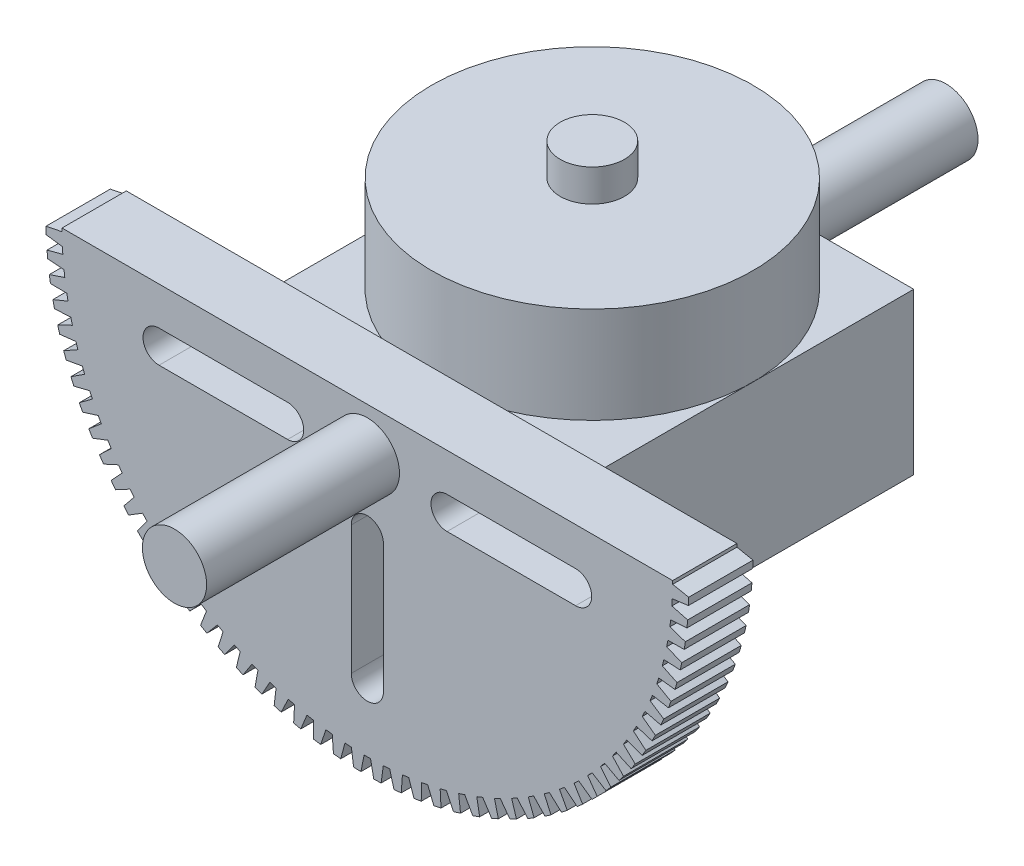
from build123d import *

# Parameters (mm, degrees)
BOSS_EXTRUDE1_DEPTH      = 5
SKETCH3_W                = 50
SKETCH3_H                = 25
BOSS_EXTRUDE2_DEPTH      = 50
SKETCH4_R                = 25
BOSS_EXTRUDE5_DEPTH      = 20
SKETCH5_R                = 25
SKETCH5_R_2              = 5
CUT_EXTRUDE1_DEPTH       = 5
BOSS_EXTRUDE7_DEPTH      = 35
BOSS_EXTRUDE7_DEPTH_BACK = 85
SKETCH6_R                = 5


with BuildPart() as part:
    # Sketch1 → Boss-Extrude1 (new, symmetric)
    with BuildSketch(Plane.XY):
        with BuildLine():
            Line((-47.5, 0), (-15, 0))
            Line((-15, 0), (15, 0))
            Line((15, 0), (47.5, 0))
            Line((47.5, 0), (47.5, -0.5))
            Line((47.5, -0.5), (49.989999, -1))
            ThreePointArc((49.989999, -1), (49.975328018, -1.570537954), (49.954145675, -2.14087128))
            Line((49.954145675, -2.14087128), (47.43766486, -2.483536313))
            Line((47.43766486, -2.483536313), (47.374874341, -3.481563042))
            Line((47.374874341, -3.481563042), (49.828564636, -4.136924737))
            ThreePointArc((49.828564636, -4.136924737), (49.77809823, -4.705415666), (49.72114616, -5.273293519))
            Line((49.72114616, -5.273293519), (47.188114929, -5.457271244))
            Line((47.188114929, -5.457271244), (47.062781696, -6.449385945))
            Line((47.062781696, -6.449385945), (49.470479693, -7.257522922))
            ThreePointArc((49.470479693, -7.257522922), (49.38441703, -7.821723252), (49.291919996, -8.384904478))
            Line((49.291919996, -8.384904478), (46.752335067, -8.409468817))
            Line((46.752335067, -8.409468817), (46.564953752, -9.391756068))
            Line((46.564953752, -9.391756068), (48.917157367, -10.349478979))
            ThreePointArc((48.917157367, -10.349478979), (48.795838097, -10.90716207), (48.668161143, -11.46342405))
            Line((48.668161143, -11.46342405), (46.132045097, -11.32847806))
            Line((46.132045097, -11.32847806), (45.88335521, -12.297061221))
            Line((45.88335521, -12.297061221), (48.170781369, -13.400590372))
            ThreePointArc((48.170781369, -13.400590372), (48.014684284, -13.949555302), (47.852331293, -14.496702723))
            Line((47.852331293, -14.496702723), (45.329693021, -14.202778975))
            Line((45.329693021, -14.202778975), (45.020676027, -15.153835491))
            Line((45.020676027, -15.153835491), (47.234297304, -16.398815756))
            ThreePointArc((47.234297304, -16.398815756), (47.044038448, -16.936896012), (46.847650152, -17.472769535))
            Line((46.847650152, -17.472769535), (44.348445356, -17.02102801))
            Line((44.348445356, -17.02102801), (43.980320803, -17.950804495))
            Line((43.980320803, -17.950804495), (46.111401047, -19.332322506))
            ThreePointArc((46.111401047, -19.332322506), (45.887731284, -19.857394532), (45.658082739, -20.379879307))
            Line((45.658082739, -20.379879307), (43.192174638, -19.772102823))
            Line((43.192174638, -19.772102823), (42.766395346, -20.676929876))
            Line((42.766395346, -20.676929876), (44.806524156, -22.189533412))
            ThreePointArc((44.806524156, -22.189533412), (44.550326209, -22.699524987), (44.288323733, -23.206559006))
            Line((44.288323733, -23.206559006), (41.865444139, -22.44514618))
            Line((41.865444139, -22.44514618), (41.383690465, -23.32145286))
            Line((41.383690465, -23.32145286), (43.324816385, -24.959172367))
            ThreePointArc((43.324816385, -24.959172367), (43.03710135, -25.452070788), (42.743778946, -25.94165302))
            Line((42.743778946, -25.94165302), (40.373489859, -25.029608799))
            Line((40.373489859, -25.029608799), (39.837663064, -25.873936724))
            Line((39.837663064, -25.873936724), (41.672125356, -27.630308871))
            ThreePointArc((41.672125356, -27.630308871), (41.354028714, -28.104168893), (41.030543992, -28.57436718))
            Line((41.030543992, -28.57436718), (38.722199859, -27.515290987))
            Line((38.722199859, -27.515290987), (38.134414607, -28.324307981))
            Line((38.134414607, -28.324307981), (39.854973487, -30.192401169))
            ThreePointArc((39.854973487, -30.192401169), (39.507750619, -30.645352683), (39.155380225, -31.094311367))
            Line((39.155380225, -31.094311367), (36.918091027, -29.892382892))
            Line((36.918091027, -29.892382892), (36.280667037, -30.662896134))
            Line((36.280667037, -30.662896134), (37.880532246, -32.635337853))
            ThreePointArc((37.880532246, -32.635337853), (37.505553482, -33.065593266), (37.125688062, -33.491540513))
            Line((37.125688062, -33.491540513), (34.968283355, -32.151503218))
            Line((34.968283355, -32.151503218), (34.28373625, -32.880471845))
            Line((34.28373625, -32.880471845), (35.75659385, -34.949477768))
            ThreePointArc((35.75659385, -34.949477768), (35.355339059, -35.355339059), (34.949477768, -35.75659385))
            Line((34.949477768, -35.75659385), (32.880471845, -34.28373625))
            Line((32.880471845, -34.28373625), (32.151503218, -34.968283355))
            Line((32.151503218, -34.968283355), (33.491540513, -37.125688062))
            ThreePointArc((33.491540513, -37.125688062), (33.065593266, -37.505553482), (32.635337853, -37.880532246))
            Line((32.635337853, -37.880532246), (30.662896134, -36.280667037))
            Line((30.662896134, -36.280667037), (29.892382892, -36.918091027))
            Line((29.892382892, -36.918091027), (31.094311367, -39.155380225))
            ThreePointArc((31.094311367, -39.155380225), (30.645352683, -39.507750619), (30.192401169, -39.854973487))
            Line((30.192401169, -39.854973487), (28.324307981, -38.134414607))
            Line((28.324307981, -38.134414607), (27.515290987, -38.722199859))
            Line((27.515290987, -38.722199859), (28.57436718, -41.030543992))
            ThreePointArc((28.57436718, -41.030543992), (28.104168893, -41.354028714), (27.630308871, -41.672125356))
            Line((27.630308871, -41.672125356), (25.873936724, -39.837663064))
            Line((25.873936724, -39.837663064), (25.029608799, -40.373489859))
            Line((25.029608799, -40.373489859), (25.94165302, -42.743778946))
            ThreePointArc((25.94165302, -42.743778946), (25.452070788, -43.03710135), (24.959172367, -43.324816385))
            Line((24.959172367, -43.324816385), (23.32145286, -41.383690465))
            Line((23.32145286, -41.383690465), (22.44514618, -41.865444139))
            Line((22.44514618, -41.865444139), (23.206559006, -44.288323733))
            ThreePointArc((23.206559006, -44.288323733), (22.699524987, -44.550326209), (22.189533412, -44.806524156))
            Line((22.189533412, -44.806524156), (20.676929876, -42.766395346))
            Line((20.676929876, -42.766395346), (19.772102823, -43.192174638))
            Line((19.772102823, -43.192174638), (20.379879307, -45.658082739))
            ThreePointArc((20.379879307, -45.658082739), (19.857394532, -45.887731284), (19.332322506, -46.111401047))
            Line((19.332322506, -46.111401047), (17.950804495, -43.980320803))
            Line((17.950804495, -43.980320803), (17.02102801, -44.348445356))
            Line((17.02102801, -44.348445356), (17.472769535, -46.847650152))
            ThreePointArc((17.472769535, -46.847650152), (16.936896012, -47.044038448), (16.398815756, -47.234297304))
            Line((16.398815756, -47.234297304), (15.153835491, -45.020676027))
            Line((15.153835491, -45.020676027), (14.202778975, -45.329693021))
            Line((14.202778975, -45.329693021), (14.496702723, -47.852331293))
            ThreePointArc((14.496702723, -47.852331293), (13.949555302, -48.014684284), (13.400590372, -48.170781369))
            Line((13.400590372, -48.170781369), (12.297061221, -45.88335521))
            Line((12.297061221, -45.88335521), (11.32847806, -46.132045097))
            Line((11.32847806, -46.132045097), (11.46342405, -48.668161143))
            ThreePointArc((11.46342405, -48.668161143), (10.90716207, -48.795838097), (10.349478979, -48.917157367))
            Line((10.349478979, -48.917157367), (9.391756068, -46.564953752))
            Line((9.391756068, -46.564953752), (8.409468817, -46.752335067))
            Line((8.409468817, -46.752335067), (8.384904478, -49.291919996))
            ThreePointArc((8.384904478, -49.291919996), (7.821723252, -49.38441703), (7.257522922, -49.470479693))
            Line((7.257522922, -49.470479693), (6.449385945, -47.062781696))
            Line((6.449385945, -47.062781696), (5.457271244, -47.188114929))
            Line((5.457271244, -47.188114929), (5.273293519, -49.72114616))
            ThreePointArc((5.273293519, -49.72114616), (4.705415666, -49.77809823), (4.136924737, -49.828564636))
            Line((4.136924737, -49.828564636), (3.481563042, -47.374874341))
            Line((3.481563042, -47.374874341), (2.483536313, -47.43766486))
            Line((2.483536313, -47.43766486), (2.14087128, -49.954145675))
            ThreePointArc((2.14087128, -49.954145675), (1.570537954, -49.975328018), (1, -49.989999))
            Line((1, -49.989999), (0.5, -47.5))
            Line((0.5, -47.5), (-0.5, -47.5))
            Line((-0.5, -47.5), (-1, -49.989999))
            ThreePointArc((-1, -49.989999), (-1.570537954, -49.975328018), (-2.14087128, -49.954145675))
            Line((-2.14087128, -49.954145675), (-2.483536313, -47.43766486))
            Line((-2.483536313, -47.43766486), (-3.481563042, -47.374874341))
            Line((-3.481563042, -47.374874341), (-4.136924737, -49.828564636))
            ThreePointArc((-4.136924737, -49.828564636), (-4.705415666, -49.77809823), (-5.273293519, -49.72114616))
            Line((-5.273293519, -49.72114616), (-5.457271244, -47.188114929))
            Line((-5.457271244, -47.188114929), (-6.449385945, -47.062781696))
            Line((-6.449385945, -47.062781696), (-7.257522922, -49.470479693))
            ThreePointArc((-7.257522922, -49.470479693), (-7.821723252, -49.38441703), (-8.384904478, -49.291919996))
            Line((-8.384904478, -49.291919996), (-8.409468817, -46.752335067))
            Line((-8.409468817, -46.752335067), (-9.391756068, -46.564953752))
            Line((-9.391756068, -46.564953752), (-10.349478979, -48.917157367))
            ThreePointArc((-10.349478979, -48.917157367), (-10.90716207, -48.795838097), (-11.46342405, -48.668161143))
            Line((-11.46342405, -48.668161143), (-11.32847806, -46.132045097))
            Line((-11.32847806, -46.132045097), (-12.297061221, -45.88335521))
            Line((-12.297061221, -45.88335521), (-13.400590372, -48.170781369))
            ThreePointArc((-13.400590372, -48.170781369), (-13.949555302, -48.014684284), (-14.496702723, -47.852331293))
            Line((-14.496702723, -47.852331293), (-14.202778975, -45.329693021))
            Line((-14.202778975, -45.329693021), (-15.153835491, -45.020676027))
            Line((-15.153835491, -45.020676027), (-16.398815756, -47.234297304))
            ThreePointArc((-16.398815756, -47.234297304), (-16.936896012, -47.044038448), (-17.472769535, -46.847650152))
            Line((-17.472769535, -46.847650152), (-17.02102801, -44.348445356))
            Line((-17.02102801, -44.348445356), (-17.950804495, -43.980320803))
            Line((-17.950804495, -43.980320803), (-19.332322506, -46.111401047))
            ThreePointArc((-19.332322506, -46.111401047), (-19.857394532, -45.887731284), (-20.379879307, -45.658082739))
            Line((-20.379879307, -45.658082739), (-19.772102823, -43.192174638))
            Line((-19.772102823, -43.192174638), (-20.676929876, -42.766395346))
            Line((-20.676929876, -42.766395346), (-22.189533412, -44.806524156))
            ThreePointArc((-22.189533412, -44.806524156), (-22.699524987, -44.550326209), (-23.206559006, -44.288323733))
            Line((-23.206559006, -44.288323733), (-22.44514618, -41.865444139))
            Line((-22.44514618, -41.865444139), (-23.32145286, -41.383690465))
            Line((-23.32145286, -41.383690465), (-24.959172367, -43.324816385))
            ThreePointArc((-24.959172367, -43.324816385), (-25.452070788, -43.03710135), (-25.94165302, -42.743778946))
            Line((-25.94165302, -42.743778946), (-25.029608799, -40.373489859))
            Line((-25.029608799, -40.373489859), (-25.873936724, -39.837663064))
            Line((-25.873936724, -39.837663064), (-27.630308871, -41.672125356))
            ThreePointArc((-27.630308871, -41.672125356), (-28.104168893, -41.354028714), (-28.57436718, -41.030543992))
            Line((-28.57436718, -41.030543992), (-27.515290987, -38.722199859))
            Line((-27.515290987, -38.722199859), (-28.324307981, -38.134414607))
            Line((-28.324307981, -38.134414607), (-30.192401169, -39.854973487))
            ThreePointArc((-30.192401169, -39.854973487), (-30.645352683, -39.507750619), (-31.094311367, -39.155380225))
            Line((-31.094311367, -39.155380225), (-29.892382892, -36.918091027))
            Line((-29.892382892, -36.918091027), (-30.662896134, -36.280667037))
            Line((-30.662896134, -36.280667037), (-32.635337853, -37.880532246))
            ThreePointArc((-32.635337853, -37.880532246), (-33.065593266, -37.505553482), (-33.491540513, -37.125688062))
            Line((-33.491540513, -37.125688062), (-32.151503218, -34.968283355))
            Line((-32.151503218, -34.968283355), (-32.880471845, -34.28373625))
            Line((-32.880471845, -34.28373625), (-34.949477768, -35.75659385))
            ThreePointArc((-34.949477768, -35.75659385), (-35.355339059, -35.355339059), (-35.75659385, -34.949477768))
            Line((-35.75659385, -34.949477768), (-34.28373625, -32.880471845))
            Line((-34.28373625, -32.880471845), (-34.968283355, -32.151503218))
            Line((-34.968283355, -32.151503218), (-37.125688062, -33.491540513))
            ThreePointArc((-37.125688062, -33.491540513), (-37.505553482, -33.065593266), (-37.880532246, -32.635337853))
            Line((-37.880532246, -32.635337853), (-36.280667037, -30.662896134))
            Line((-36.280667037, -30.662896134), (-36.918091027, -29.892382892))
            Line((-36.918091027, -29.892382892), (-39.155380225, -31.094311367))
            ThreePointArc((-39.155380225, -31.094311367), (-39.507750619, -30.645352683), (-39.854973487, -30.192401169))
            Line((-39.854973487, -30.192401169), (-38.134414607, -28.324307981))
            Line((-38.134414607, -28.324307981), (-38.722199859, -27.515290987))
            Line((-38.722199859, -27.515290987), (-41.030543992, -28.57436718))
            ThreePointArc((-41.030543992, -28.57436718), (-41.354028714, -28.104168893), (-41.672125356, -27.630308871))
            Line((-41.672125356, -27.630308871), (-39.837663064, -25.873936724))
            Line((-39.837663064, -25.873936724), (-40.373489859, -25.029608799))
            Line((-40.373489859, -25.029608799), (-42.743778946, -25.94165302))
            ThreePointArc((-42.743778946, -25.94165302), (-43.03710135, -25.452070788), (-43.324816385, -24.959172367))
            Line((-43.324816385, -24.959172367), (-41.383690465, -23.32145286))
            Line((-41.383690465, -23.32145286), (-41.865444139, -22.44514618))
            Line((-41.865444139, -22.44514618), (-44.288323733, -23.206559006))
            ThreePointArc((-44.288323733, -23.206559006), (-44.550326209, -22.699524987), (-44.806524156, -22.189533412))
            Line((-44.806524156, -22.189533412), (-42.766395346, -20.676929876))
            Line((-42.766395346, -20.676929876), (-43.192174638, -19.772102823))
            Line((-43.192174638, -19.772102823), (-45.658082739, -20.379879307))
            ThreePointArc((-45.658082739, -20.379879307), (-45.887731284, -19.857394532), (-46.111401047, -19.332322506))
            Line((-46.111401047, -19.332322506), (-43.980320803, -17.950804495))
            Line((-43.980320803, -17.950804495), (-44.348445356, -17.02102801))
            Line((-44.348445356, -17.02102801), (-46.847650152, -17.472769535))
            ThreePointArc((-46.847650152, -17.472769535), (-47.044038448, -16.936896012), (-47.234297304, -16.398815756))
            Line((-47.234297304, -16.398815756), (-45.020676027, -15.153835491))
            Line((-45.020676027, -15.153835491), (-45.329693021, -14.202778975))
            Line((-45.329693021, -14.202778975), (-47.852331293, -14.496702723))
            ThreePointArc((-47.852331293, -14.496702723), (-48.014684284, -13.949555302), (-48.170781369, -13.400590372))
            Line((-48.170781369, -13.400590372), (-45.88335521, -12.297061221))
            Line((-45.88335521, -12.297061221), (-46.132045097, -11.32847806))
            Line((-46.132045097, -11.32847806), (-48.668161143, -11.46342405))
            ThreePointArc((-48.668161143, -11.46342405), (-48.795838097, -10.90716207), (-48.917157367, -10.349478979))
            Line((-48.917157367, -10.349478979), (-46.564953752, -9.391756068))
            Line((-46.564953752, -9.391756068), (-46.752335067, -8.409468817))
            Line((-46.752335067, -8.409468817), (-49.291919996, -8.384904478))
            ThreePointArc((-49.291919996, -8.384904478), (-49.38441703, -7.821723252), (-49.470479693, -7.257522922))
            Line((-49.470479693, -7.257522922), (-47.062781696, -6.449385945))
            Line((-47.062781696, -6.449385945), (-47.188114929, -5.457271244))
            Line((-47.188114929, -5.457271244), (-49.72114616, -5.273293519))
            ThreePointArc((-49.72114616, -5.273293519), (-49.77809823, -4.705415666), (-49.828564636, -4.136924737))
            Line((-49.828564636, -4.136924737), (-47.374874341, -3.481563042))
            Line((-47.374874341, -3.481563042), (-47.43766486, -2.483536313))
            Line((-47.43766486, -2.483536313), (-49.954145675, -2.14087128))
            ThreePointArc((-49.954145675, -2.14087128), (-49.975328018, -1.570537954), (-49.989999, -1))
            Line((-49.989999, -1), (-47.5, -0.5))
            Line((-47.5, -0.5), (-47.5, 0))
        make_face()
        with BuildLine():
            Line((2.5, -17.5), (2.5, -37.5))
            ThreePointArc((2.5, -37.5), (0, -40), (-2.5, -37.5))
            Line((-2.5, -37.5), (-2.5, -17.5))
            ThreePointArc((-2.5, -17.5), (0, -15), (2.5, -17.5))
        make_face(mode=Mode.SUBTRACT)
        with BuildLine():
            Line((-32.401817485, -5.936375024), (-12.401817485, -5.936375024))
            ThreePointArc((-12.401817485, -5.936375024), (-9.901817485, -8.436375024), (-12.401817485, -10.936375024))
            Line((-12.401817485, -10.936375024), (-32.401817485, -10.936375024))
            ThreePointArc((-32.401817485, -10.936375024), (-34.901817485, -8.436375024), (-32.401817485, -5.936375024))
        make_face(mode=Mode.SUBTRACT)
        with BuildLine():
            Line((12.401817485, -5.936375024), (32.401817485, -5.936375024))
            ThreePointArc((32.401817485, -5.936375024), (34.901817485, -8.436375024), (32.401817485, -10.936375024))
            Line((32.401817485, -10.936375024), (12.401817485, -10.936375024))
            ThreePointArc((12.401817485, -10.936375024), (9.901817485, -8.436375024), (12.401817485, -5.936375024))
        make_face(mode=Mode.SUBTRACT)
    extrude(amount=BOSS_EXTRUDE1_DEPTH, both=True)

    # Sketch3 → Boss-Extrude2 (add)
    with BuildSketch(Plane(origin=(0, 0, -5), x_dir=(-1, 0, 0), z_dir=(0, 0, -1))):
        with Locations((0, -14.5)):
            Rectangle(SKETCH3_W, SKETCH3_H)
    extrude(amount=BOSS_EXTRUDE2_DEPTH)


with BuildPart() as body_2:
    # Sketch4 → Boss-Extrude5 (new body)
    with BuildSketch(Plane(origin=(0, -2, 0), x_dir=(1, 0, 0), z_dir=(0, 1, 0))):
        with Locations(Location((0, 30, 0), (0, 0, 180))):
            Circle(SKETCH4_R)
    extrude(amount=BOSS_EXTRUDE5_DEPTH)

    # Sketch5 → Cut-Extrude1 (cut)
    with BuildSketch(Plane(origin=(0, 18, 0), x_dir=(1, 0, 0), z_dir=(0, 1, 0))):
        with Locations(Location((0, 30, 0), (0, 0, 180))):
            Circle(SKETCH5_R)
        with Locations(Location((0, 30, 0), (0, 0, 180))):
            Circle(SKETCH5_R_2, mode=Mode.SUBTRACT)
    extrude(amount=-CUT_EXTRUDE1_DEPTH, mode=Mode.SUBTRACT)


with BuildPart() as body_3:
    # Sketch6 → Boss-Extrude7 (new, two sides: drawn at the far end of the back side and taken through both)
    with BuildSketch(Plane.XY.offset(-BOSS_EXTRUDE7_DEPTH_BACK)):
        with Locations((0, -6.809646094)):
            Circle(SKETCH6_R)
    extrude(amount=BOSS_EXTRUDE7_DEPTH + BOSS_EXTRUDE7_DEPTH_BACK)


solid = Compound([part.part, body_2.part, body_3.part])
